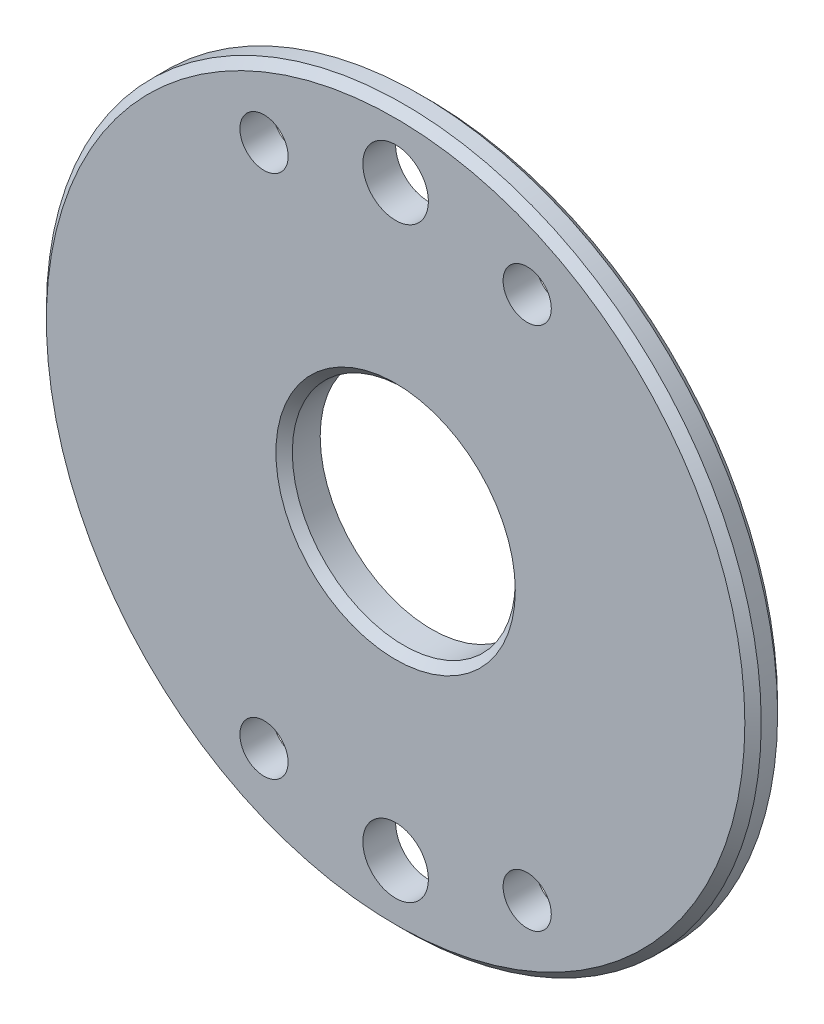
ISO-10303-21;
HEADER;
FILE_DESCRIPTION(('STEP AP214'),'2;1');
FILE_NAME('part.step','',(''),(''),'','','');
FILE_SCHEMA(('AUTOMOTIVE_DESIGN { 1 0 10303 214 1 1 1 1 }'));
ENDSEC;
DATA;
#1=APPLICATION_CONTEXT('core data for automotive mechanical design processes');
#2=APPLICATION_PROTOCOL_DEFINITION('international standard','automotive_design',2000,#1);
#3=PRODUCT_CONTEXT('',#1,'mechanical');
#4=PRODUCT('Part','Part','',(#3));
#5=PRODUCT_RELATED_PRODUCT_CATEGORY('part','',(#4));
#6=PRODUCT_DEFINITION_FORMATION('','',#4);
#7=PRODUCT_DEFINITION_CONTEXT('part definition',#1,'design');
#8=PRODUCT_DEFINITION('design','',#6,#7);
#9=PRODUCT_DEFINITION_SHAPE('','',#8);
#10=(LENGTH_UNIT() NAMED_UNIT(*) SI_UNIT(.MILLI.,.METRE.));
#11=(NAMED_UNIT(*) PLANE_ANGLE_UNIT() SI_UNIT($,.RADIAN.));
#12=(NAMED_UNIT(*) SI_UNIT($,.STERADIAN.) SOLID_ANGLE_UNIT());
#13=UNCERTAINTY_MEASURE_WITH_UNIT(LENGTH_MEASURE(1.E-05),#10,'distance_accuracy_value','');
#14=(GEOMETRIC_REPRESENTATION_CONTEXT(3) GLOBAL_UNCERTAINTY_ASSIGNED_CONTEXT((#13)) GLOBAL_UNIT_ASSIGNED_CONTEXT((#10,
#11,#12)) REPRESENTATION_CONTEXT('',''));
#15=CARTESIAN_POINT('',(0.,0.,0.));
#16=DIRECTION('',(0.,0.,1.));
#17=DIRECTION('',(1.,0.,0.));
#18=AXIS2_PLACEMENT_3D('',#15,#16,#17);
#19=CARTESIAN_POINT('',(0.,-89.5,10.));
#20=DIRECTION('',(0.,0.,-1.));
#21=DIRECTION('',(-1.,0.,0.));
#22=AXIS2_PLACEMENT_3D('',#19,#20,#21);
#23=CYLINDRICAL_SURFACE('',#22,10.0000000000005);
#24=CARTESIAN_POINT('',(0.,-89.5,10.));
#25=DIRECTION('',(0.,0.,1.));
#26=DIRECTION('',(1.,0.,0.));
#27=AXIS2_PLACEMENT_3D('',#24,#25,#26);
#28=CIRCLE('',#27,10.0000000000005);
#29=CARTESIAN_POINT('',(10.0000000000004,-89.5,10.));
#30=VERTEX_POINT('',#29);
#31=EDGE_CURVE('E75',#30,#30,#28,.T.);
#32=ORIENTED_EDGE('',*,*,#31,.T.);
#33=EDGE_LOOP('',(#32));
#34=FACE_BOUND('',#33,.T.);
#35=CARTESIAN_POINT('',(0.,-89.5,0.));
#36=DIRECTION('',(0.,0.,1.));
#37=DIRECTION('',(1.,0.,0.));
#38=AXIS2_PLACEMENT_3D('',#35,#36,#37);
#39=CIRCLE('',#38,10.0000000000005);
#40=CARTESIAN_POINT('',(10.0000000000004,-89.5,0.));
#41=VERTEX_POINT('',#40);
#42=EDGE_CURVE('E63',#41,#41,#39,.T.);
#43=ORIENTED_EDGE('',*,*,#42,.F.);
#44=EDGE_LOOP('',(#43));
#45=FACE_BOUND('',#44,.T.);
#46=ADVANCED_FACE('F41',(#34,#45),#23,.F.);
#47=CARTESIAN_POINT('',(0.,89.5000000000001,10.));
#48=DIRECTION('',(0.,0.,-1.));
#49=DIRECTION('',(-1.,0.,0.));
#50=AXIS2_PLACEMENT_3D('',#47,#48,#49);
#51=CYLINDRICAL_SURFACE('',#50,10.);
#52=CARTESIAN_POINT('',(0.,89.5000000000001,10.));
#53=DIRECTION('',(0.,0.,1.));
#54=DIRECTION('',(1.,0.,0.));
#55=AXIS2_PLACEMENT_3D('',#52,#53,#54);
#56=CIRCLE('',#55,10.);
#57=CARTESIAN_POINT('',(9.99999999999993,89.5000000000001,10.));
#58=VERTEX_POINT('',#57);
#59=EDGE_CURVE('E72',#58,#58,#56,.T.);
#60=ORIENTED_EDGE('',*,*,#59,.T.);
#61=EDGE_LOOP('',(#60));
#62=FACE_BOUND('',#61,.T.);
#63=CARTESIAN_POINT('',(0.,89.5000000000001,0.));
#64=DIRECTION('',(0.,0.,1.));
#65=DIRECTION('',(1.,0.,0.));
#66=AXIS2_PLACEMENT_3D('',#63,#64,#65);
#67=CIRCLE('',#66,10.);
#68=CARTESIAN_POINT('',(9.99999999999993,89.5000000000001,0.));
#69=VERTEX_POINT('',#68);
#70=EDGE_CURVE('E91',#69,#69,#67,.T.);
#71=ORIENTED_EDGE('',*,*,#70,.F.);
#72=EDGE_LOOP('',(#71));
#73=FACE_BOUND('',#72,.T.);
#74=ADVANCED_FACE('F150',(#62,#73),#51,.F.);
#75=CARTESIAN_POINT('',(0.,0.,10.));
#76=DIRECTION('',(0.,0.,-1.));
#77=DIRECTION('',(-1.,0.,0.));
#78=AXIS2_PLACEMENT_3D('',#75,#76,#77);
#79=CYLINDRICAL_SURFACE('',#78,34.);
#80=CARTESIAN_POINT('',(0.,0.,7.50000000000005));
#81=DIRECTION('',(0.,0.,1.));
#82=DIRECTION('',(1.,0.,0.));
#83=AXIS2_PLACEMENT_3D('',#80,#81,#82);
#84=CIRCLE('',#83,34.);
#85=CARTESIAN_POINT('',(34.,0.,7.50000000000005));
#86=VERTEX_POINT('',#85);
#87=EDGE_CURVE('E78',#86,#86,#84,.T.);
#88=ORIENTED_EDGE('',*,*,#87,.T.);
#89=EDGE_LOOP('',(#88));
#90=FACE_BOUND('',#89,.T.);
#91=CARTESIAN_POINT('',(0.,0.,-1.));
#92=DIRECTION('',(0.,0.,-1.));
#93=DIRECTION('',(-1.,0.,0.));
#94=AXIS2_PLACEMENT_3D('',#91,#92,#93);
#95=CIRCLE('',#94,34.);
#96=CARTESIAN_POINT('',(-34.,0.,-1.));
#97=VERTEX_POINT('',#96);
#98=EDGE_CURVE('E269',#97,#97,#95,.T.);
#99=ORIENTED_EDGE('',*,*,#98,.T.);
#100=EDGE_LOOP('',(#99));
#101=FACE_BOUND('',#100,.T.);
#102=ADVANCED_FACE('F168',(#90,#101),#79,.F.);
#103=CARTESIAN_POINT('',(-40.1279204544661,80.0000000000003,10.));
#104=DIRECTION('',(0.,0.,-1.));
#105=DIRECTION('',(-1.,0.,0.));
#106=AXIS2_PLACEMENT_3D('',#103,#104,#105);
#107=CYLINDRICAL_SURFACE('',#106,7.35);
#108=CARTESIAN_POINT('',(-40.1279204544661,80.0000000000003,10.));
#109=DIRECTION('',(0.,0.,1.));
#110=DIRECTION('',(1.,0.,0.));
#111=AXIS2_PLACEMENT_3D('',#108,#109,#110);
#112=CIRCLE('',#111,7.35);
#113=CARTESIAN_POINT('',(-32.7779204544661,80.0000000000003,10.));
#114=VERTEX_POINT('',#113);
#115=EDGE_CURVE('E69',#114,#114,#112,.T.);
#116=ORIENTED_EDGE('',*,*,#115,.T.);
#117=EDGE_LOOP('',(#116));
#118=FACE_BOUND('',#117,.T.);
#119=CARTESIAN_POINT('',(-40.1279204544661,80.0000000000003,0.));
#120=DIRECTION('',(0.,0.,1.));
#121=DIRECTION('',(1.,0.,0.));
#122=AXIS2_PLACEMENT_3D('',#119,#120,#121);
#123=CIRCLE('',#122,7.35);
#124=CARTESIAN_POINT('',(-32.7779204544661,80.0000000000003,0.));
#125=VERTEX_POINT('',#124);
#126=EDGE_CURVE('E88',#125,#125,#123,.T.);
#127=ORIENTED_EDGE('',*,*,#126,.F.);
#128=EDGE_LOOP('',(#127));
#129=FACE_BOUND('',#128,.T.);
#130=ADVANCED_FACE('F171',(#118,#129),#107,.F.);
#131=CARTESIAN_POINT('',(40.1279204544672,79.9999999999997,10.));
#132=DIRECTION('',(0.,0.,-1.));
#133=DIRECTION('',(-1.,0.,0.));
#134=AXIS2_PLACEMENT_3D('',#131,#132,#133);
#135=CYLINDRICAL_SURFACE('',#134,7.35);
#136=CARTESIAN_POINT('',(40.1279204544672,79.9999999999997,10.));
#137=DIRECTION('',(0.,0.,1.));
#138=DIRECTION('',(1.,0.,0.));
#139=AXIS2_PLACEMENT_3D('',#136,#137,#138);
#140=CIRCLE('',#139,7.35);
#141=CARTESIAN_POINT('',(47.4779204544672,79.9999999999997,10.));
#142=VERTEX_POINT('',#141);
#143=EDGE_CURVE('E66',#142,#142,#140,.T.);
#144=ORIENTED_EDGE('',*,*,#143,.T.);
#145=EDGE_LOOP('',(#144));
#146=FACE_BOUND('',#145,.T.);
#147=CARTESIAN_POINT('',(40.1279204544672,79.9999999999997,0.));
#148=DIRECTION('',(0.,0.,1.));
#149=DIRECTION('',(1.,0.,0.));
#150=AXIS2_PLACEMENT_3D('',#147,#148,#149);
#151=CIRCLE('',#150,7.35);
#152=CARTESIAN_POINT('',(47.4779204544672,79.9999999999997,0.));
#153=VERTEX_POINT('',#152);
#154=EDGE_CURVE('E85',#153,#153,#151,.T.);
#155=ORIENTED_EDGE('',*,*,#154,.F.);
#156=EDGE_LOOP('',(#155));
#157=FACE_BOUND('',#156,.T.);
#158=ADVANCED_FACE('F175',(#146,#157),#135,.F.);
#159=CARTESIAN_POINT('',(40.1279204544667,-80.,10.));
#160=DIRECTION('',(0.,0.,-1.));
#161=DIRECTION('',(-1.,0.,0.));
#162=AXIS2_PLACEMENT_3D('',#159,#160,#161);
#163=CYLINDRICAL_SURFACE('',#162,7.35);
#164=CARTESIAN_POINT('',(40.1279204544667,-80.,10.));
#165=DIRECTION('',(0.,0.,1.));
#166=DIRECTION('',(1.,0.,0.));
#167=AXIS2_PLACEMENT_3D('',#164,#165,#166);
#168=CIRCLE('',#167,7.35);
#169=CARTESIAN_POINT('',(47.4779204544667,-80.,10.));
#170=VERTEX_POINT('',#169);
#171=EDGE_CURVE('E62',#170,#170,#168,.T.);
#172=ORIENTED_EDGE('',*,*,#171,.T.);
#173=EDGE_LOOP('',(#172));
#174=FACE_BOUND('',#173,.T.);
#175=CARTESIAN_POINT('',(40.1279204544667,-80.,0.));
#176=DIRECTION('',(0.,0.,1.));
#177=DIRECTION('',(1.,0.,0.));
#178=AXIS2_PLACEMENT_3D('',#175,#176,#177);
#179=CIRCLE('',#178,7.35);
#180=CARTESIAN_POINT('',(47.4779204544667,-80.,0.));
#181=VERTEX_POINT('',#180);
#182=EDGE_CURVE('E82',#181,#181,#179,.T.);
#183=ORIENTED_EDGE('',*,*,#182,.F.);
#184=EDGE_LOOP('',(#183));
#185=FACE_BOUND('',#184,.T.);
#186=ADVANCED_FACE('F179',(#174,#185),#163,.F.);
#187=CARTESIAN_POINT('',(-40.1279204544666,-80.,10.));
#188=DIRECTION('',(0.,0.,-1.));
#189=DIRECTION('',(-1.,0.,0.));
#190=AXIS2_PLACEMENT_3D('',#187,#188,#189);
#191=CYLINDRICAL_SURFACE('',#190,7.35);
#192=CARTESIAN_POINT('',(-40.1279204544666,-80.,10.));
#193=DIRECTION('',(0.,0.,1.));
#194=DIRECTION('',(1.,0.,0.));
#195=AXIS2_PLACEMENT_3D('',#192,#193,#194);
#196=CIRCLE('',#195,7.35);
#197=CARTESIAN_POINT('',(-32.7779204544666,-80.,10.));
#198=VERTEX_POINT('',#197);
#199=EDGE_CURVE('E59',#198,#198,#196,.T.);
#200=ORIENTED_EDGE('',*,*,#199,.T.);
#201=EDGE_LOOP('',(#200));
#202=FACE_BOUND('',#201,.T.);
#203=CARTESIAN_POINT('',(-40.1279204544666,-80.,0.));
#204=DIRECTION('',(0.,0.,1.));
#205=DIRECTION('',(1.,0.,0.));
#206=AXIS2_PLACEMENT_3D('',#203,#204,#205);
#207=CIRCLE('',#206,7.35);
#208=CARTESIAN_POINT('',(-32.7779204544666,-80.,0.));
#209=VERTEX_POINT('',#208);
#210=EDGE_CURVE('E79',#209,#209,#207,.T.);
#211=ORIENTED_EDGE('',*,*,#210,.F.);
#212=EDGE_LOOP('',(#211));
#213=FACE_BOUND('',#212,.T.);
#214=ADVANCED_FACE('F122',(#202,#213),#191,.F.);
#215=CARTESIAN_POINT('',(0.,0.,10.));
#216=DIRECTION('',(0.,0.,-1.));
#217=DIRECTION('',(-1.,0.,0.));
#218=AXIS2_PLACEMENT_3D('',#215,#216,#217);
#219=CYLINDRICAL_SURFACE('',#218,109.);
#220=CARTESIAN_POINT('',(0.,0.,2.49999999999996));
#221=DIRECTION('',(0.,0.,1.));
#222=DIRECTION('',(1.,0.,0.));
#223=AXIS2_PLACEMENT_3D('',#220,#221,#222);
#224=CIRCLE('',#223,109.);
#225=CARTESIAN_POINT('',(109.,0.,2.49999999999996));
#226=VERTEX_POINT('',#225);
#227=EDGE_CURVE('E104',#226,#226,#224,.T.);
#228=ORIENTED_EDGE('',*,*,#227,.T.);
#229=EDGE_LOOP('',(#228));
#230=FACE_BOUND('',#229,.T.);
#231=CARTESIAN_POINT('',(0.,0.,7.49999999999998));
#232=DIRECTION('',(0.,0.,1.));
#233=DIRECTION('',(1.,0.,0.));
#234=AXIS2_PLACEMENT_3D('',#231,#232,#233);
#235=CIRCLE('',#234,109.);
#236=CARTESIAN_POINT('',(109.,0.,7.49999999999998));
#237=VERTEX_POINT('',#236);
#238=EDGE_CURVE('E101',#237,#237,#235,.F.);
#239=ORIENTED_EDGE('',*,*,#238,.T.);
#240=EDGE_LOOP('',(#239));
#241=FACE_BOUND('',#240,.T.);
#242=ADVANCED_FACE('F118',(#230,#241),#219,.T.);
#243=CARTESIAN_POINT('',(0.,0.,10.));
#244=DIRECTION('',(0.,0.,1.));
#245=DIRECTION('',(1.,0.,0.));
#246=AXIS2_PLACEMENT_3D('',#243,#244,#245);
#247=PLANE('',#246);
#248=CARTESIAN_POINT('',(0.,0.,10.));
#249=DIRECTION('',(0.,0.,1.));
#250=DIRECTION('',(1.,0.,0.));
#251=AXIS2_PLACEMENT_3D('',#248,#249,#250);
#252=CIRCLE('',#251,106.5);
#253=CARTESIAN_POINT('',(106.5,0.,10.));
#254=VERTEX_POINT('',#253);
#255=EDGE_CURVE('E46',#254,#254,#252,.T.);
#256=ORIENTED_EDGE('',*,*,#255,.T.);
#257=EDGE_LOOP('',(#256));
#258=FACE_BOUND('',#257,.T.);
#259=CARTESIAN_POINT('',(0.,0.,10.));
#260=DIRECTION('',(0.,0.,1.));
#261=DIRECTION('',(1.,0.,0.));
#262=AXIS2_PLACEMENT_3D('',#259,#260,#261);
#263=CIRCLE('',#262,36.5);
#264=CARTESIAN_POINT('',(36.5,0.,10.));
#265=VERTEX_POINT('',#264);
#266=EDGE_CURVE('E98',#265,#265,#263,.F.);
#267=ORIENTED_EDGE('',*,*,#266,.T.);
#268=EDGE_LOOP('',(#267));
#269=FACE_BOUND('',#268,.T.);
#270=ORIENTED_EDGE('',*,*,#199,.F.);
#271=EDGE_LOOP('',(#270));
#272=FACE_BOUND('',#271,.T.);
#273=ORIENTED_EDGE('',*,*,#171,.F.);
#274=EDGE_LOOP('',(#273));
#275=FACE_BOUND('',#274,.T.);
#276=ORIENTED_EDGE('',*,*,#143,.F.);
#277=EDGE_LOOP('',(#276));
#278=FACE_BOUND('',#277,.T.);
#279=ORIENTED_EDGE('',*,*,#115,.F.);
#280=EDGE_LOOP('',(#279));
#281=FACE_BOUND('',#280,.T.);
#282=ORIENTED_EDGE('',*,*,#59,.F.);
#283=EDGE_LOOP('',(#282));
#284=FACE_BOUND('',#283,.T.);
#285=ORIENTED_EDGE('',*,*,#31,.F.);
#286=EDGE_LOOP('',(#285));
#287=FACE_BOUND('',#286,.T.);
#288=ADVANCED_FACE('F121',(#258,#269,#272,#275,#278,#281,#284,#287),#247,.T.);
#289=CARTESIAN_POINT('',(0.,0.,0.));
#290=DIRECTION('',(0.,0.,1.));
#291=DIRECTION('',(1.,0.,0.));
#292=AXIS2_PLACEMENT_3D('',#289,#290,#291);
#293=PLANE('',#292);
#294=CARTESIAN_POINT('',(0.,0.,0.));
#295=DIRECTION('',(0.,0.,-1.));
#296=DIRECTION('',(-1.,0.,0.));
#297=AXIS2_PLACEMENT_3D('',#294,#295,#296);
#298=CIRCLE('',#297,75.);
#299=CARTESIAN_POINT('',(-75.,0.,0.));
#300=VERTEX_POINT('',#299);
#301=EDGE_CURVE('E10',#300,#300,#298,.T.);
#302=ORIENTED_EDGE('',*,*,#301,.F.);
#303=EDGE_LOOP('',(#302));
#304=FACE_BOUND('',#303,.T.);
#305=CARTESIAN_POINT('',(0.,0.,0.));
#306=DIRECTION('',(0.,0.,1.));
#307=DIRECTION('',(1.,0.,0.));
#308=AXIS2_PLACEMENT_3D('',#305,#306,#307);
#309=CIRCLE('',#308,106.5);
#310=CARTESIAN_POINT('',(106.5,0.,0.));
#311=VERTEX_POINT('',#310);
#312=EDGE_CURVE('E54',#311,#311,#309,.F.);
#313=ORIENTED_EDGE('',*,*,#312,.T.);
#314=EDGE_LOOP('',(#313));
#315=FACE_BOUND('',#314,.T.);
#316=ORIENTED_EDGE('',*,*,#210,.T.);
#317=EDGE_LOOP('',(#316));
#318=FACE_BOUND('',#317,.T.);
#319=ORIENTED_EDGE('',*,*,#182,.T.);
#320=EDGE_LOOP('',(#319));
#321=FACE_BOUND('',#320,.T.);
#322=ORIENTED_EDGE('',*,*,#154,.T.);
#323=EDGE_LOOP('',(#322));
#324=FACE_BOUND('',#323,.T.);
#325=ORIENTED_EDGE('',*,*,#126,.T.);
#326=EDGE_LOOP('',(#325));
#327=FACE_BOUND('',#326,.T.);
#328=ORIENTED_EDGE('',*,*,#70,.T.);
#329=EDGE_LOOP('',(#328));
#330=FACE_BOUND('',#329,.T.);
#331=ORIENTED_EDGE('',*,*,#42,.T.);
#332=EDGE_LOOP('',(#331));
#333=FACE_BOUND('',#332,.T.);
#334=ADVANCED_FACE('F109',(#304,#315,#318,#321,#324,#327,#330,#333),#293,.F.);
#335=CARTESIAN_POINT('',(0.,0.,7.50000000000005));
#336=DIRECTION('',(0.,0.,1.));
#337=DIRECTION('',(1.,0.,0.));
#338=AXIS2_PLACEMENT_3D('',#335,#336,#337);
#339=CONICAL_SURFACE('',#338,34.,0.785398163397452);
#340=ORIENTED_EDGE('',*,*,#266,.F.);
#341=EDGE_LOOP('',(#340));
#342=FACE_BOUND('',#341,.T.);
#343=ORIENTED_EDGE('',*,*,#87,.F.);
#344=EDGE_LOOP('',(#343));
#345=FACE_BOUND('',#344,.T.);
#346=ADVANCED_FACE('F115',(#342,#345),#339,.F.);
#347=CARTESIAN_POINT('',(0.,0.,2.49999999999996));
#348=DIRECTION('',(0.,0.,1.));
#349=DIRECTION('',(1.,0.,0.));
#350=AXIS2_PLACEMENT_3D('',#347,#348,#349);
#351=CONICAL_SURFACE('',#350,109.,0.785398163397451);
#352=ORIENTED_EDGE('',*,*,#312,.F.);
#353=EDGE_LOOP('',(#352));
#354=FACE_BOUND('',#353,.T.);
#355=ORIENTED_EDGE('',*,*,#227,.F.);
#356=EDGE_LOOP('',(#355));
#357=FACE_BOUND('',#356,.T.);
#358=ADVANCED_FACE('F112',(#354,#357),#351,.T.);
#359=CARTESIAN_POINT('',(0.,0.,10.));
#360=DIRECTION('',(0.,0.,-1.));
#361=DIRECTION('',(-1.,0.,0.));
#362=AXIS2_PLACEMENT_3D('',#359,#360,#361);
#363=CONICAL_SURFACE('',#362,106.5,0.785398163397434);
#364=ORIENTED_EDGE('',*,*,#238,.F.);
#365=EDGE_LOOP('',(#364));
#366=FACE_BOUND('',#365,.T.);
#367=ORIENTED_EDGE('',*,*,#255,.F.);
#368=EDGE_LOOP('',(#367));
#369=FACE_BOUND('',#368,.T.);
#370=ADVANCED_FACE('F44',(#366,#369),#363,.T.);
#371=CARTESIAN_POINT('',(0.,0.,-1.));
#372=DIRECTION('',(0.,0.,-1.));
#373=DIRECTION('',(-1.,0.,0.));
#374=AXIS2_PLACEMENT_3D('',#371,#372,#373);
#375=PLANE('',#374);
#376=CARTESIAN_POINT('',(0.,0.,-1.));
#377=DIRECTION('',(0.,0.,-1.));
#378=DIRECTION('',(-1.,0.,0.));
#379=AXIS2_PLACEMENT_3D('',#376,#377,#378);
#380=CIRCLE('',#379,75.);
#381=CARTESIAN_POINT('',(-75.,0.,-1.));
#382=VERTEX_POINT('',#381);
#383=EDGE_CURVE('E57',#382,#382,#380,.T.);
#384=ORIENTED_EDGE('',*,*,#383,.T.);
#385=EDGE_LOOP('',(#384));
#386=FACE_BOUND('',#385,.T.);
#387=ORIENTED_EDGE('',*,*,#98,.F.);
#388=EDGE_LOOP('',(#387));
#389=FACE_BOUND('',#388,.T.);
#390=ADVANCED_FACE('F128',(#386,#389),#375,.T.);
#391=CARTESIAN_POINT('',(0.,0.,-1.));
#392=DIRECTION('',(0.,0.,1.));
#393=DIRECTION('',(1.,0.,0.));
#394=AXIS2_PLACEMENT_3D('',#391,#392,#393);
#395=CYLINDRICAL_SURFACE('',#394,75.);
#396=ORIENTED_EDGE('',*,*,#383,.F.);
#397=EDGE_LOOP('',(#396));
#398=FACE_BOUND('',#397,.T.);
#399=ORIENTED_EDGE('',*,*,#301,.T.);
#400=EDGE_LOOP('',(#399));
#401=FACE_BOUND('',#400,.T.);
#402=ADVANCED_FACE('F255',(#398,#401),#395,.T.);
#403=CLOSED_SHELL('',(#46,#74,#102,#130,#158,#186,#214,#242,#288,#334,#346,#358,#370,#390,#402));
#404=MANIFOLD_SOLID_BREP('B2',#403);
#405=ADVANCED_BREP_SHAPE_REPRESENTATION('',(#18,#404),#14);
#406=SHAPE_DEFINITION_REPRESENTATION(#9,#405);
ENDSEC;
END-ISO-10303-21;
